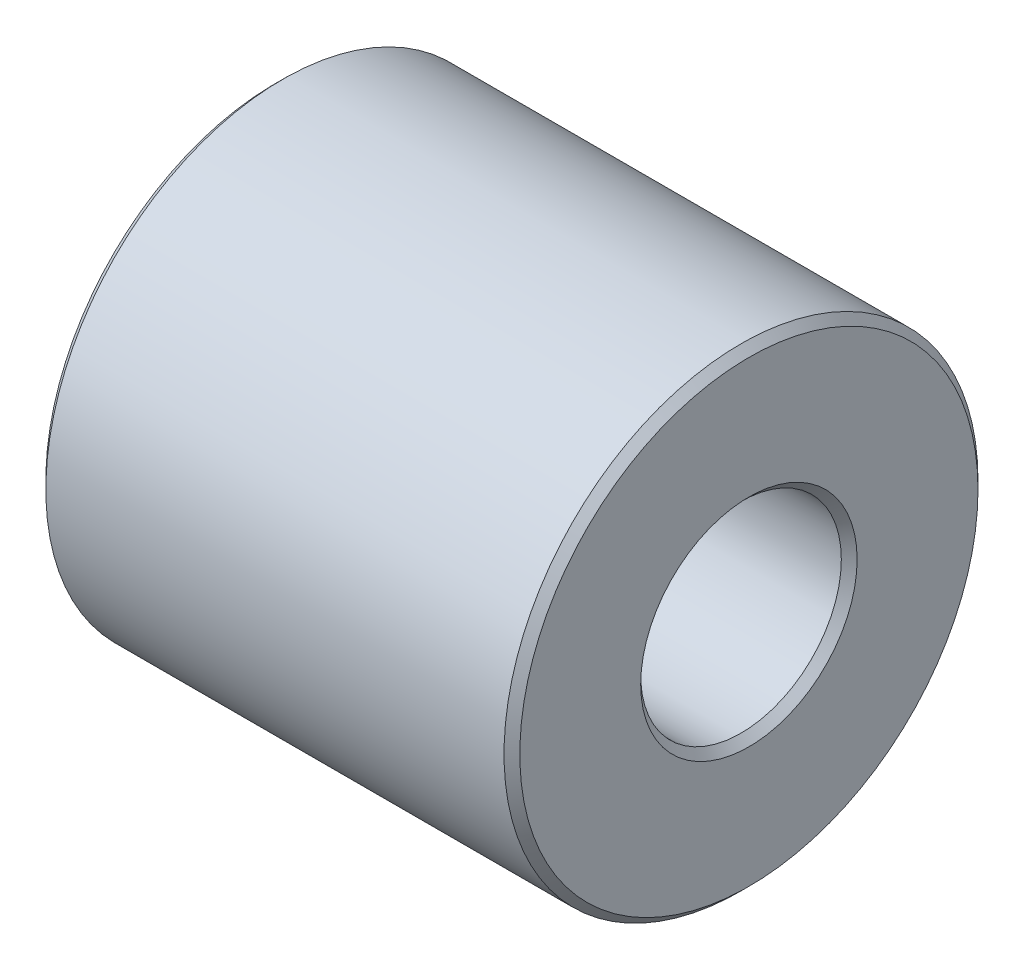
from build123d import *

# Parameters (mm, degrees)
SKETCH_1_R      = 15
SKETCH_1_R_2    = 6.35
EXTRUDE_1_DEPTH = 30
CHAMFER_1_SIZE  = 0.5


with BuildPart() as part:
    # Sketch 1 → Extrude 1 (new body)
    with BuildSketch(Plane(origin=(0, 0, 0), x_dir=(0, 0, -1), z_dir=(1, 0, 0))):
        Circle(SKETCH_1_R)
        Circle(SKETCH_1_R_2, mode=Mode.SUBTRACT)
    extrude(amount=EXTRUDE_1_DEPTH)

    # Chamfer 1
    chamfer_1_edges = [part.edges().sort_by_distance(p)[0] for p in [
        (0, 0, 15),
        (30, 0, 15),
        (0, 0, 6.35),
        (30, 0, 6.35),
    ]]
    chamfer(chamfer_1_edges, length=CHAMFER_1_SIZE)


solid = part.part
